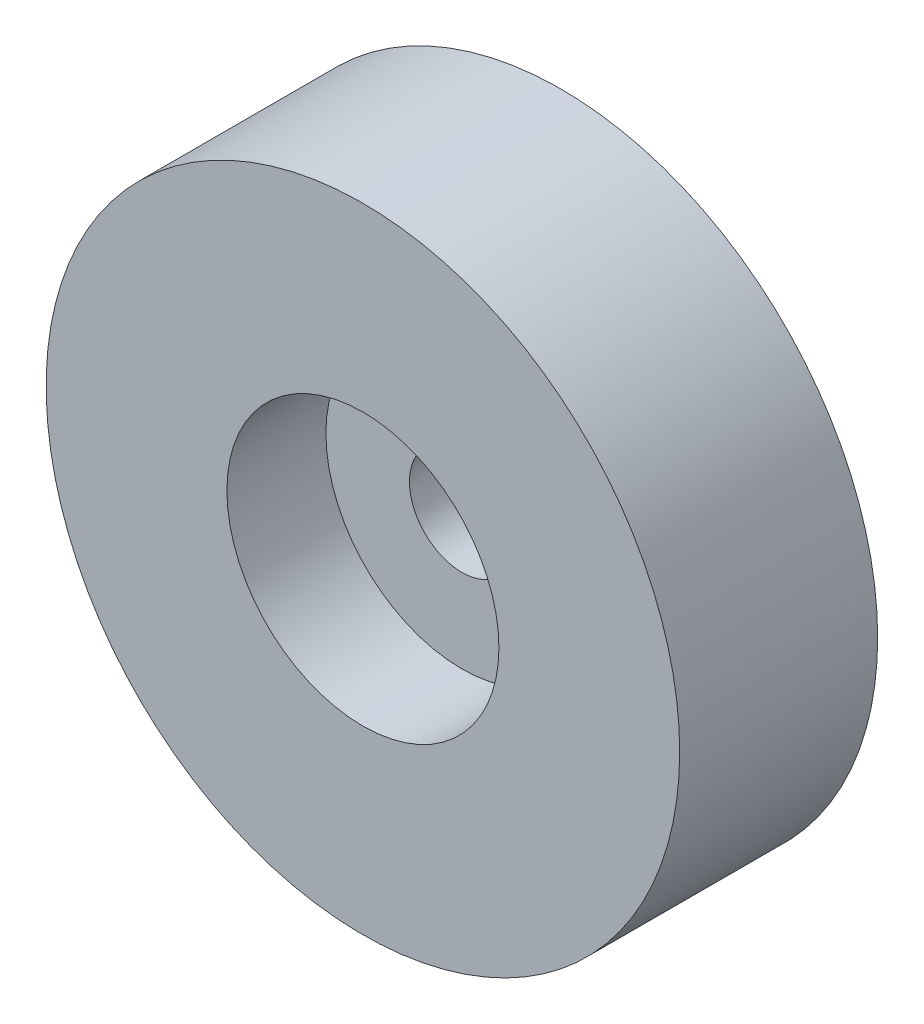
ISO-10303-21;
HEADER;
FILE_DESCRIPTION(('STEP AP214'),'2;1');
FILE_NAME('part.step','',(''),(''),'','','');
FILE_SCHEMA(('AUTOMOTIVE_DESIGN { 1 0 10303 214 1 1 1 1 }'));
ENDSEC;
DATA;
#1=APPLICATION_CONTEXT('core data for automotive mechanical design processes');
#2=APPLICATION_PROTOCOL_DEFINITION('international standard','automotive_design',2000,#1);
#3=PRODUCT_CONTEXT('',#1,'mechanical');
#4=PRODUCT('Part','Part','',(#3));
#5=PRODUCT_RELATED_PRODUCT_CATEGORY('part','',(#4));
#6=PRODUCT_DEFINITION_FORMATION('','',#4);
#7=PRODUCT_DEFINITION_CONTEXT('part definition',#1,'design');
#8=PRODUCT_DEFINITION('design','',#6,#7);
#9=PRODUCT_DEFINITION_SHAPE('','',#8);
#10=(LENGTH_UNIT() NAMED_UNIT(*) SI_UNIT(.MILLI.,.METRE.));
#11=(NAMED_UNIT(*) PLANE_ANGLE_UNIT() SI_UNIT($,.RADIAN.));
#12=(NAMED_UNIT(*) SI_UNIT($,.STERADIAN.) SOLID_ANGLE_UNIT());
#13=UNCERTAINTY_MEASURE_WITH_UNIT(LENGTH_MEASURE(1.E-05),#10,'distance_accuracy_value','');
#14=(GEOMETRIC_REPRESENTATION_CONTEXT(3) GLOBAL_UNCERTAINTY_ASSIGNED_CONTEXT((#13)) GLOBAL_UNIT_ASSIGNED_CONTEXT((#10,
#11,#12)) REPRESENTATION_CONTEXT('',''));
#15=CARTESIAN_POINT('',(0.,0.,0.));
#16=DIRECTION('',(0.,0.,1.));
#17=DIRECTION('',(1.,0.,0.));
#18=AXIS2_PLACEMENT_3D('',#15,#16,#17);
#19=CARTESIAN_POINT('',(0.,0.,0.));
#20=DIRECTION('',(0.,0.,1.));
#21=DIRECTION('',(1.,0.,0.));
#22=AXIS2_PLACEMENT_3D('',#19,#20,#21);
#23=PLANE('',#22);
#24=CARTESIAN_POINT('',(0.,0.,0.));
#25=DIRECTION('',(0.,0.,1.));
#26=DIRECTION('',(1.,0.,0.));
#27=AXIS2_PLACEMENT_3D('',#24,#25,#26);
#28=CIRCLE('',#27,20.32);
#29=CARTESIAN_POINT('',(20.32,0.,0.));
#30=VERTEX_POINT('',#29);
#31=EDGE_CURVE('E39',#30,#30,#28,.T.);
#32=ORIENTED_EDGE('',*,*,#31,.F.);
#33=EDGE_LOOP('',(#32));
#34=FACE_BOUND('',#33,.T.);
#35=CARTESIAN_POINT('',(0.,0.,0.));
#36=DIRECTION('',(0.,0.,-1.));
#37=DIRECTION('',(-1.,0.,0.));
#38=AXIS2_PLACEMENT_3D('',#35,#36,#37);
#39=CIRCLE('',#38,8.509);
#40=CARTESIAN_POINT('',(8.509,0.,0.));
#41=VERTEX_POINT('',#40);
#42=EDGE_CURVE('E10',#41,#41,#39,.T.);
#43=ORIENTED_EDGE('',*,*,#42,.F.);
#44=EDGE_LOOP('',(#43));
#45=FACE_BOUND('',#44,.T.);
#46=ADVANCED_FACE('F27',(#34,#45),#23,.F.);
#47=CARTESIAN_POINT('',(0.,0.,12.7));
#48=DIRECTION('',(0.,0.,-1.));
#49=DIRECTION('',(-1.,0.,0.));
#50=AXIS2_PLACEMENT_3D('',#47,#48,#49);
#51=CYLINDRICAL_SURFACE('',#50,20.32);
#52=CARTESIAN_POINT('',(0.,0.,12.7));
#53=DIRECTION('',(0.,0.,1.));
#54=DIRECTION('',(1.,0.,0.));
#55=AXIS2_PLACEMENT_3D('',#52,#53,#54);
#56=CIRCLE('',#55,20.32);
#57=CARTESIAN_POINT('',(20.32,0.,12.7));
#58=VERTEX_POINT('',#57);
#59=EDGE_CURVE('E31',#58,#58,#56,.T.);
#60=ORIENTED_EDGE('',*,*,#59,.F.);
#61=EDGE_LOOP('',(#60));
#62=FACE_BOUND('',#61,.T.);
#63=ORIENTED_EDGE('',*,*,#31,.T.);
#64=EDGE_LOOP('',(#63));
#65=FACE_BOUND('',#64,.T.);
#66=ADVANCED_FACE('F29',(#62,#65),#51,.T.);
#67=CARTESIAN_POINT('',(0.,0.,12.7));
#68=DIRECTION('',(0.,0.,1.));
#69=DIRECTION('',(1.,0.,0.));
#70=AXIS2_PLACEMENT_3D('',#67,#68,#69);
#71=PLANE('',#70);
#72=CARTESIAN_POINT('',(0.,0.,12.7));
#73=DIRECTION('',(0.,0.,1.));
#74=DIRECTION('',(1.,0.,0.));
#75=AXIS2_PLACEMENT_3D('',#72,#73,#74);
#76=CIRCLE('',#75,8.7249);
#77=CARTESIAN_POINT('',(8.7249,0.,12.7));
#78=VERTEX_POINT('',#77);
#79=EDGE_CURVE('E49',#78,#78,#76,.T.);
#80=ORIENTED_EDGE('',*,*,#79,.F.);
#81=EDGE_LOOP('',(#80));
#82=FACE_BOUND('',#81,.T.);
#83=ORIENTED_EDGE('',*,*,#59,.T.);
#84=EDGE_LOOP('',(#83));
#85=FACE_BOUND('',#84,.T.);
#86=ADVANCED_FACE('F61',(#82,#85),#71,.T.);
#87=CARTESIAN_POINT('',(0.,0.,6.35));
#88=DIRECTION('',(0.,0.,1.));
#89=DIRECTION('',(1.,0.,0.));
#90=AXIS2_PLACEMENT_3D('',#87,#88,#89);
#91=CYLINDRICAL_SURFACE('',#90,8.7249);
#92=CARTESIAN_POINT('',(0.,0.,6.35));
#93=DIRECTION('',(0.,0.,1.));
#94=DIRECTION('',(1.,0.,0.));
#95=AXIS2_PLACEMENT_3D('',#92,#93,#94);
#96=CIRCLE('',#95,8.7249);
#97=CARTESIAN_POINT('',(8.7249,0.,6.35));
#98=VERTEX_POINT('',#97);
#99=EDGE_CURVE('E52',#98,#98,#96,.T.);
#100=ORIENTED_EDGE('',*,*,#99,.F.);
#101=EDGE_LOOP('',(#100));
#102=FACE_BOUND('',#101,.T.);
#103=ORIENTED_EDGE('',*,*,#79,.T.);
#104=EDGE_LOOP('',(#103));
#105=FACE_BOUND('',#104,.T.);
#106=ADVANCED_FACE('F69',(#102,#105),#91,.F.);
#107=CARTESIAN_POINT('',(0.,0.,6.35));
#108=DIRECTION('',(0.,0.,1.));
#109=DIRECTION('',(1.,0.,0.));
#110=AXIS2_PLACEMENT_3D('',#107,#108,#109);
#111=PLANE('',#110);
#112=CARTESIAN_POINT('',(0.,0.,6.35));
#113=DIRECTION('',(0.,0.,1.));
#114=DIRECTION('',(1.,0.,0.));
#115=AXIS2_PLACEMENT_3D('',#112,#113,#114);
#116=CIRCLE('',#115,3.3655);
#117=CARTESIAN_POINT('',(3.3655,0.,6.35));
#118=VERTEX_POINT('',#117);
#119=EDGE_CURVE('E46',#118,#118,#116,.T.);
#120=ORIENTED_EDGE('',*,*,#119,.F.);
#121=EDGE_LOOP('',(#120));
#122=FACE_BOUND('',#121,.T.);
#123=ORIENTED_EDGE('',*,*,#99,.T.);
#124=EDGE_LOOP('',(#123));
#125=FACE_BOUND('',#124,.T.);
#126=ADVANCED_FACE('F66',(#122,#125),#111,.T.);
#127=CARTESIAN_POINT('',(0.,0.,0.));
#128=DIRECTION('',(0.,0.,1.));
#129=DIRECTION('',(1.,0.,0.));
#130=AXIS2_PLACEMENT_3D('',#127,#128,#129);
#131=CYLINDRICAL_SURFACE('',#130,3.3655);
#132=CARTESIAN_POINT('',(0.,0.,-7.62));
#133=DIRECTION('',(0.,0.,-1.));
#134=DIRECTION('',(-1.,0.,0.));
#135=AXIS2_PLACEMENT_3D('',#132,#133,#134);
#136=CIRCLE('',#135,3.3655);
#137=CARTESIAN_POINT('',(3.3655,0.,-7.62));
#138=VERTEX_POINT('',#137);
#139=EDGE_CURVE('E42',#138,#138,#136,.T.);
#140=CARTESIAN_POINT('',(3.3655,0.,6.35));
#141=CARTESIAN_POINT('',(3.3655,0.,6.20447916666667));
#142=CARTESIAN_POINT('',(3.3655,0.,6.05895833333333));
#143=CARTESIAN_POINT('',(3.3655,0.,5.76791666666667));
#144=CARTESIAN_POINT('',(3.3655,0.,5.62239583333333));
#145=CARTESIAN_POINT('',(3.3655,0.,5.33135416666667));
#146=CARTESIAN_POINT('',(3.3655,0.,5.18583333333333));
#147=CARTESIAN_POINT('',(3.3655,0.,4.89479166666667));
#148=CARTESIAN_POINT('',(3.3655,0.,4.74927083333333));
#149=CARTESIAN_POINT('',(3.3655,0.,4.45822916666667));
#150=CARTESIAN_POINT('',(3.3655,0.,4.31270833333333));
#151=CARTESIAN_POINT('',(3.3655,0.,4.02166666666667));
#152=CARTESIAN_POINT('',(3.3655,0.,3.87614583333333));
#153=CARTESIAN_POINT('',(3.3655,0.,3.58510416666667));
#154=CARTESIAN_POINT('',(3.3655,0.,3.43958333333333));
#155=CARTESIAN_POINT('',(3.3655,0.,3.14854166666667));
#156=CARTESIAN_POINT('',(3.3655,0.,3.00302083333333));
#157=CARTESIAN_POINT('',(3.3655,0.,2.71197916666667));
#158=CARTESIAN_POINT('',(3.3655,0.,2.56645833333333));
#159=CARTESIAN_POINT('',(3.3655,0.,2.27541666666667));
#160=CARTESIAN_POINT('',(3.3655,0.,2.12989583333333));
#161=CARTESIAN_POINT('',(3.3655,0.,1.83885416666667));
#162=CARTESIAN_POINT('',(3.3655,0.,1.69333333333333));
#163=CARTESIAN_POINT('',(3.3655,0.,1.40229166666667));
#164=CARTESIAN_POINT('',(3.3655,0.,1.25677083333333));
#165=CARTESIAN_POINT('',(3.3655,0.,0.965729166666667));
#166=CARTESIAN_POINT('',(3.3655,0.,0.820208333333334));
#167=CARTESIAN_POINT('',(3.3655,0.,0.529166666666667));
#168=CARTESIAN_POINT('',(3.3655,0.,0.383645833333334));
#169=CARTESIAN_POINT('',(3.3655,0.,0.0926041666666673));
#170=CARTESIAN_POINT('',(3.3655,0.,-0.0529166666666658));
#171=CARTESIAN_POINT('',(3.3655,0.,-0.343958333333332));
#172=CARTESIAN_POINT('',(3.3655,0.,-0.489479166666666));
#173=CARTESIAN_POINT('',(3.3655,0.,-0.780520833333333));
#174=CARTESIAN_POINT('',(3.3655,0.,-0.926041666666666));
#175=CARTESIAN_POINT('',(3.3655,0.,-1.21708333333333));
#176=CARTESIAN_POINT('',(3.3655,0.,-1.36260416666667));
#177=CARTESIAN_POINT('',(3.3655,0.,-1.65364583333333));
#178=CARTESIAN_POINT('',(3.3655,0.,-1.79916666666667));
#179=CARTESIAN_POINT('',(3.3655,0.,-2.09020833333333));
#180=CARTESIAN_POINT('',(3.3655,0.,-2.23572916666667));
#181=CARTESIAN_POINT('',(3.3655,0.,-2.52677083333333));
#182=CARTESIAN_POINT('',(3.3655,0.,-2.67229166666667));
#183=CARTESIAN_POINT('',(3.3655,0.,-2.96333333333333));
#184=CARTESIAN_POINT('',(3.3655,0.,-3.10885416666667));
#185=CARTESIAN_POINT('',(3.3655,0.,-3.39989583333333));
#186=CARTESIAN_POINT('',(3.3655,0.,-3.54541666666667));
#187=CARTESIAN_POINT('',(3.3655,0.,-3.83645833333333));
#188=CARTESIAN_POINT('',(3.3655,0.,-3.98197916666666));
#189=CARTESIAN_POINT('',(3.3655,0.,-4.27302083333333));
#190=CARTESIAN_POINT('',(3.3655,0.,-4.41854166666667));
#191=CARTESIAN_POINT('',(3.3655,0.,-4.70958333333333));
#192=CARTESIAN_POINT('',(3.3655,0.,-4.85510416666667));
#193=CARTESIAN_POINT('',(3.3655,0.,-5.14614583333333));
#194=CARTESIAN_POINT('',(3.3655,0.,-5.29166666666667));
#195=CARTESIAN_POINT('',(3.3655,0.,-5.58270833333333));
#196=CARTESIAN_POINT('',(3.3655,0.,-5.72822916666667));
#197=CARTESIAN_POINT('',(3.3655,0.,-6.01927083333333));
#198=CARTESIAN_POINT('',(3.3655,0.,-6.16479166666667));
#199=CARTESIAN_POINT('',(3.3655,0.,-6.45583333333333));
#200=CARTESIAN_POINT('',(3.3655,0.,-6.60135416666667));
#201=CARTESIAN_POINT('',(3.3655,0.,-6.89239583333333));
#202=CARTESIAN_POINT('',(3.3655,0.,-7.03791666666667));
#203=CARTESIAN_POINT('',(3.3655,0.,-7.32895833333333));
#204=CARTESIAN_POINT('',(3.3655,0.,-7.47447916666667));
#205=CARTESIAN_POINT('',(3.3655,0.,-7.62));
#206=B_SPLINE_CURVE_WITH_KNOTS('',3,(#140,#141,#142,#143,#144,#145,#146,#147,#148,#149,#150,
#151,#152,#153,#154,#155,#156,#157,#158,#159,#160,#161,#162,#163,#164,#165,#166,#167,#168,#169,
#170,#171,#172,#173,#174,#175,#176,#177,#178,#179,#180,#181,#182,#183,#184,#185,#186,#187,#188,
#189,#190,#191,#192,#193,#194,#195,#196,#197,#198,#199,#200,#201,#202,#203,#204,#205),
.UNSPECIFIED.,.F.,.F.,(4,2,2,2,2,2,2,2,2,2,2,2,2,2,2,2,2,2,2,2,2,2,2,2,2,2,2,2,2,2,2,2,4),(0.,
0.4365625,0.873125,1.3096875,1.74625,2.1828125,2.619375,3.0559375,3.4925,3.9290625,4.365625,
4.8021875,5.23875,5.6753125,6.111875,6.5484375,6.985,7.4215625,7.858125,8.2946875,8.73125,
9.1678125,9.604375,10.0409375,10.4775,10.9140625,11.350625,11.7871875,12.22375,12.6603125,
13.096875,13.5334375,13.97),.UNSPECIFIED.);
#207=EDGE_CURVE('BSEAM75',#118,#138,#206,.T.);
#208=ORIENTED_EDGE('',*,*,#119,.T.);
#209=ORIENTED_EDGE('',*,*,#139,.T.);
#210=ORIENTED_EDGE('',*,*,#207,.T.);
#211=ORIENTED_EDGE('',*,*,#207,.F.);
#212=EDGE_LOOP('',(#208,#210,#209,#211));
#213=FACE_BOUND('',#212,.T.);
#214=ADVANCED_FACE('F75',(#213),#131,.F.);
#215=CARTESIAN_POINT('',(0.,0.,-7.62));
#216=DIRECTION('',(0.,0.,-1.));
#217=DIRECTION('',(-1.,0.,0.));
#218=AXIS2_PLACEMENT_3D('',#215,#216,#217);
#219=PLANE('',#218);
#220=CARTESIAN_POINT('',(0.,0.,-7.62));
#221=DIRECTION('',(0.,0.,-1.));
#222=DIRECTION('',(-1.,0.,0.));
#223=AXIS2_PLACEMENT_3D('',#220,#221,#222);
#224=CIRCLE('',#223,8.509);
#225=CARTESIAN_POINT('',(8.509,0.,-7.62));
#226=VERTEX_POINT('',#225);
#227=EDGE_CURVE('E43',#226,#226,#224,.T.);
#228=ORIENTED_EDGE('',*,*,#227,.T.);
#229=EDGE_LOOP('',(#228));
#230=FACE_BOUND('',#229,.T.);
#231=ORIENTED_EDGE('',*,*,#139,.F.);
#232=EDGE_LOOP('',(#231));
#233=FACE_BOUND('',#232,.T.);
#234=ADVANCED_FACE('F87',(#230,#233),#219,.T.);
#235=CARTESIAN_POINT('',(0.,0.,-7.62));
#236=DIRECTION('',(0.,0.,1.));
#237=DIRECTION('',(1.,0.,0.));
#238=AXIS2_PLACEMENT_3D('',#235,#236,#237);
#239=CYLINDRICAL_SURFACE('',#238,8.509);
#240=CARTESIAN_POINT('',(8.509,0.,-7.62));
#241=CARTESIAN_POINT('',(8.509,0.,-7.540625));
#242=CARTESIAN_POINT('',(8.509,0.,-7.46125));
#243=CARTESIAN_POINT('',(8.509,0.,-7.3025));
#244=CARTESIAN_POINT('',(8.509,0.,-7.223125));
#245=CARTESIAN_POINT('',(8.509,0.,-7.064375));
#246=CARTESIAN_POINT('',(8.509,0.,-6.985));
#247=CARTESIAN_POINT('',(8.509,0.,-6.82625));
#248=CARTESIAN_POINT('',(8.509,0.,-6.746875));
#249=CARTESIAN_POINT('',(8.509,0.,-6.588125));
#250=CARTESIAN_POINT('',(8.509,0.,-6.50875));
#251=CARTESIAN_POINT('',(8.509,0.,-6.35));
#252=CARTESIAN_POINT('',(8.509,0.,-6.270625));
#253=CARTESIAN_POINT('',(8.509,0.,-6.111875));
#254=CARTESIAN_POINT('',(8.509,0.,-6.0325));
#255=CARTESIAN_POINT('',(8.509,0.,-5.87375));
#256=CARTESIAN_POINT('',(8.509,0.,-5.794375));
#257=CARTESIAN_POINT('',(8.509,0.,-5.635625));
#258=CARTESIAN_POINT('',(8.509,0.,-5.55625));
#259=CARTESIAN_POINT('',(8.509,0.,-5.3975));
#260=CARTESIAN_POINT('',(8.509,0.,-5.318125));
#261=CARTESIAN_POINT('',(8.509,0.,-5.159375));
#262=CARTESIAN_POINT('',(8.509,0.,-5.08));
#263=CARTESIAN_POINT('',(8.509,0.,-4.92125));
#264=CARTESIAN_POINT('',(8.509,0.,-4.841875));
#265=CARTESIAN_POINT('',(8.509,0.,-4.683125));
#266=CARTESIAN_POINT('',(8.509,0.,-4.60375));
#267=CARTESIAN_POINT('',(8.509,0.,-4.445));
#268=CARTESIAN_POINT('',(8.509,0.,-4.365625));
#269=CARTESIAN_POINT('',(8.509,0.,-4.206875));
#270=CARTESIAN_POINT('',(8.509,0.,-4.1275));
#271=CARTESIAN_POINT('',(8.509,0.,-3.96875));
#272=CARTESIAN_POINT('',(8.509,0.,-3.889375));
#273=CARTESIAN_POINT('',(8.509,0.,-3.730625));
#274=CARTESIAN_POINT('',(8.509,0.,-3.65125));
#275=CARTESIAN_POINT('',(8.509,0.,-3.4925));
#276=CARTESIAN_POINT('',(8.509,0.,-3.413125));
#277=CARTESIAN_POINT('',(8.509,0.,-3.254375));
#278=CARTESIAN_POINT('',(8.509,0.,-3.175));
#279=CARTESIAN_POINT('',(8.509,0.,-3.01625));
#280=CARTESIAN_POINT('',(8.509,0.,-2.936875));
#281=CARTESIAN_POINT('',(8.509,0.,-2.778125));
#282=CARTESIAN_POINT('',(8.509,0.,-2.69875));
#283=CARTESIAN_POINT('',(8.509,0.,-2.54));
#284=CARTESIAN_POINT('',(8.509,0.,-2.460625));
#285=CARTESIAN_POINT('',(8.509,0.,-2.301875));
#286=CARTESIAN_POINT('',(8.509,0.,-2.2225));
#287=CARTESIAN_POINT('',(8.509,0.,-2.06375));
#288=CARTESIAN_POINT('',(8.509,0.,-1.984375));
#289=CARTESIAN_POINT('',(8.509,0.,-1.825625));
#290=CARTESIAN_POINT('',(8.509,0.,-1.74625));
#291=CARTESIAN_POINT('',(8.509,0.,-1.5875));
#292=CARTESIAN_POINT('',(8.509,0.,-1.508125));
#293=CARTESIAN_POINT('',(8.509,0.,-1.349375));
#294=CARTESIAN_POINT('',(8.509,0.,-1.27));
#295=CARTESIAN_POINT('',(8.509,0.,-1.11125));
#296=CARTESIAN_POINT('',(8.509,0.,-1.031875));
#297=CARTESIAN_POINT('',(8.509,0.,-0.873125));
#298=CARTESIAN_POINT('',(8.509,0.,-0.79375));
#299=CARTESIAN_POINT('',(8.509,0.,-0.635));
#300=CARTESIAN_POINT('',(8.509,0.,-0.555625));
#301=CARTESIAN_POINT('',(8.509,0.,-0.396875));
#302=CARTESIAN_POINT('',(8.509,0.,-0.3175));
#303=CARTESIAN_POINT('',(8.509,0.,-0.15875));
#304=CARTESIAN_POINT('',(8.509,0.,-0.0793749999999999));
#305=CARTESIAN_POINT('',(8.509,0.,0.));
#306=B_SPLINE_CURVE_WITH_KNOTS('',3,(#240,#241,#242,#243,#244,#245,#246,#247,#248,#249,#250,
#251,#252,#253,#254,#255,#256,#257,#258,#259,#260,#261,#262,#263,#264,#265,#266,#267,#268,#269,
#270,#271,#272,#273,#274,#275,#276,#277,#278,#279,#280,#281,#282,#283,#284,#285,#286,#287,#288,
#289,#290,#291,#292,#293,#294,#295,#296,#297,#298,#299,#300,#301,#302,#303,#304,#305),
.UNSPECIFIED.,.F.,.F.,(4,2,2,2,2,2,2,2,2,2,2,2,2,2,2,2,2,2,2,2,2,2,2,2,2,2,2,2,2,2,2,2,4),(0.,
0.238125,0.47625,0.714375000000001,0.9525,1.190625,1.42875,1.666875,1.905,2.143125,2.38125,
2.619375,2.8575,3.095625,3.33375,3.571875,3.81,4.048125,4.28625,4.524375,4.7625,5.000625,
5.23875,5.476875,5.715,5.953125,6.19125,6.429375,6.6675,6.905625,7.14375,7.381875,7.62),.UNSPECIFIED.);
#307=EDGE_CURVE('BSEAM93',#226,#41,#306,.T.);
#308=ORIENTED_EDGE('',*,*,#227,.F.);
#309=ORIENTED_EDGE('',*,*,#42,.T.);
#310=ORIENTED_EDGE('',*,*,#307,.T.);
#311=ORIENTED_EDGE('',*,*,#307,.F.);
#312=EDGE_LOOP('',(#308,#310,#309,#311));
#313=FACE_BOUND('',#312,.T.);
#314=ADVANCED_FACE('F93',(#313),#239,.T.);
#315=CLOSED_SHELL('',(#46,#66,#86,#106,#126,#214,#234,#314));
#316=MANIFOLD_SOLID_BREP('B2',#315);
#317=ADVANCED_BREP_SHAPE_REPRESENTATION('',(#18,#316),#14);
#318=SHAPE_DEFINITION_REPRESENTATION(#9,#317);
ENDSEC;
END-ISO-10303-21;
